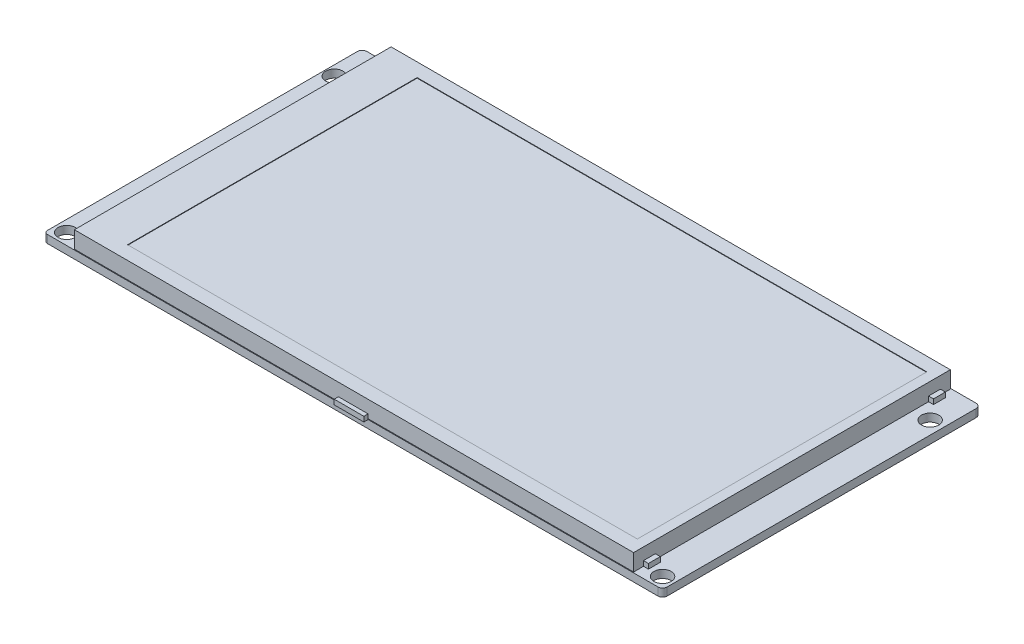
from build123d import *

# Parameters (mm, degrees)
SKETCH_1_R          = 1.75
EXTRUDE_1_DEPTH     = 1.6
SKETCH_1_3_W        = 113
SKETCH_1_3_H        = 64
SKETCH_1_3_W_2      = 103
SKETCH_1_3_H_2      = 58.5
EXTRUDE_2_DEPTH     = 5
EXTRUDE_START       = 1.6
SKETCH_1_4_W        = 6
SKETCH_1_4_H        = 0.85
SKETCH_1_4_W_2      = 1
SKETCH_1_4_H_2      = 2.4
EXTRUDE_3_DEPTH     = 1
CUT_EXTRUDE_START   = 5
SKETCH_1_5_W        = 103
SKETCH_1_5_H        = 58.5
CUT_EXTRUDE_1_DEPTH = 0.1
SKETCH_1_6_W        = 6
SKETCH_1_6_H        = 0.85
EXTRUDE_4_DEPTH     = 1
EXTRUDE_4_2_DEPTH   = 1


with BuildPart() as part:
    # Sketch 1 → Extrude 1 (new body)
    with BuildSketch(Plane(origin=(0, 0, 0), x_dir=(1, 0, 0), z_dir=(0, 1, 0))):
        with BuildLine():
            Line((-61.552075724, 32.15), (61.552075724, 32.15))
            ThreePointArc((61.552075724, 32.15), (62.222359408, 31.872359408), (62.5, 31.202075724))
            Line((62.5, 31.202075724), (62.5, -31.202075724))
            ThreePointArc((62.5, -31.202075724), (62.222359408, -31.872359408), (61.552075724, -32.15))
            Line((61.552075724, -32.15), (-61.797073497, -32.15))
            ThreePointArc((-61.797073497, -32.15), (-62.294117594, -31.944117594), (-62.5, -31.447073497))
            Line((-62.5, -31.447073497), (-62.5, 31.202075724))
            ThreePointArc((-62.5, 31.202075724), (-62.222359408, 31.872359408), (-61.552075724, 32.15))
        make_face()
        with Locations(Location((-60.2, -29.85, 0), (0, 0, 270))):
            Circle(SKETCH_1_R, mode=Mode.SUBTRACT)
        with Locations(Location((60.2, -29.85, 0), (0, 0, 270))):
            Circle(SKETCH_1_R, mode=Mode.SUBTRACT)
        with Locations(Location((-60.525462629, 24.549026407, 0), (0, 0, 270))):
            Circle(SKETCH_1_R, mode=Mode.SUBTRACT)
        with Locations(Location((59.874537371, 24.549026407, 0), (0, 0, 270))):
            Circle(SKETCH_1_R, mode=Mode.SUBTRACT)
    extrude(amount=EXTRUDE_1_DEPTH)

    # Sketch 1_3 → Extrude 2 (add)
    with BuildSketch(Plane(origin=(0, 0, 0), x_dir=(1, 0, 0), z_dir=(0, 1, 0))):
        Rectangle(SKETCH_1_3_W, SKETCH_1_3_H)
        with Locations((3, 0)):
            Rectangle(SKETCH_1_3_W_2, SKETCH_1_3_H_2)
    extrude(amount=EXTRUDE_2_DEPTH)

    # Sketch 1_4 → Extrude 3 (add)
    with BuildSketch(Plane(origin=(0, 0, 0), x_dir=(1, 0, 0), z_dir=(0, 1, 0)).offset(EXTRUDE_START)):
        with Locations((0, 32.575)):
            Rectangle(SKETCH_1_4_W, SKETCH_1_4_H)
        with Locations((-57, 28.8)):
            Rectangle(SKETCH_1_4_W_2, SKETCH_1_4_H_2)
        with Locations((0, -32.575)):
            Rectangle(SKETCH_1_4_W, SKETCH_1_4_H)
        with Locations((57, 28.8)):
            Rectangle(SKETCH_1_4_W_2, SKETCH_1_4_H_2)
        with Locations((57, -28.8)):
            Rectangle(SKETCH_1_4_W_2, SKETCH_1_4_H_2)
        with Locations((-57, -28.8)):
            Rectangle(SKETCH_1_4_W_2, SKETCH_1_4_H_2)
    extrude(amount=EXTRUDE_3_DEPTH)


with BuildPart() as extrude_3_piece_1:
    # of the separate pieces the step leaves, piece 1, a body of its own (extrude_3_pieces)
    add(part.part.solids().sort_by_distance((-61.552075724, 0, -32.15))[0])

    # Sketch 1_5 → Cut-Extrude 1 (cut)
    with BuildSketch(Plane(origin=(0, 0, 0), x_dir=(1, 0, 0), z_dir=(0, 1, 0)).offset(CUT_EXTRUDE_START)):
        with Locations((3, 0)):
            Rectangle(SKETCH_1_5_W, SKETCH_1_5_H)
    extrude(amount=-CUT_EXTRUDE_1_DEPTH, mode=Mode.SUBTRACT)


with BuildPart() as extrude_3_piece_2:
    # of the separate pieces the step leaves, piece 2, a body of its own (extrude_3_pieces)
    add(part.part.solids().sort_by_distance((3, 2.6, -32.15))[0])


with BuildPart() as extrude_3_piece_3:
    # of the separate pieces the step leaves, piece 3, a body of its own (extrude_3_pieces)
    add(part.part.solids().sort_by_distance((3, 2.6, 32.15))[0])


with BuildPart() as body_4:
    # Sketch 1_6 → Extrude 4 (new body)
    with BuildSketch(Plane(origin=(0, 0, 0), x_dir=(1, 0, 0), z_dir=(0, 1, 0)).offset(EXTRUDE_START)):
        with Locations((0, 32.575)):
            Rectangle(SKETCH_1_6_W, SKETCH_1_6_H)
    extrude(amount=EXTRUDE_4_DEPTH)


with BuildPart() as body_5:
    # Sketch 1_6 → Extrude 4 2 (new body)
    with BuildSketch(Plane(origin=(0, 0, 0), x_dir=(1, 0, 0), z_dir=(0, 1, 0)).offset(EXTRUDE_START)):
        with Locations((0, -32.575)):
            Rectangle(SKETCH_1_6_W, SKETCH_1_6_H)
    extrude(amount=EXTRUDE_4_2_DEPTH)


solid = Compound([extrude_3_piece_1.part, extrude_3_piece_2.part, extrude_3_piece_3.part, body_4.part, body_5.part])
